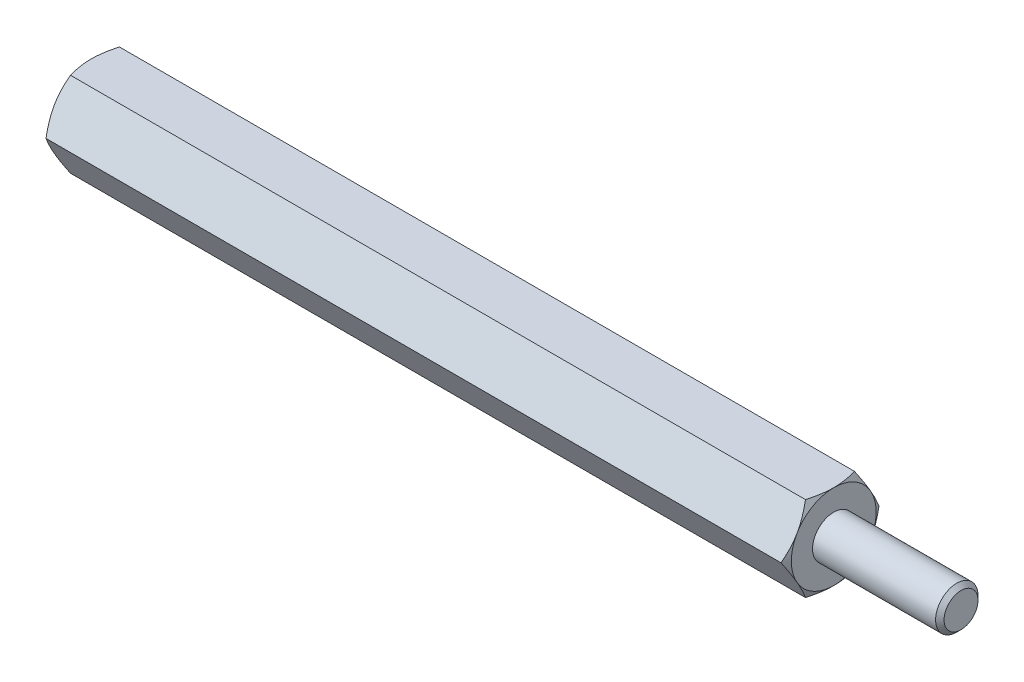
ISO-10303-21;
HEADER;
FILE_DESCRIPTION(('STEP AP214'),'2;1');
FILE_NAME('part.step','',(''),(''),'','','');
FILE_SCHEMA(('AUTOMOTIVE_DESIGN { 1 0 10303 214 1 1 1 1 }'));
ENDSEC;
DATA;
#1=APPLICATION_CONTEXT('core data for automotive mechanical design processes');
#2=APPLICATION_PROTOCOL_DEFINITION('international standard','automotive_design',2000,#1);
#3=PRODUCT_CONTEXT('',#1,'mechanical');
#4=PRODUCT('Part','Part','',(#3));
#5=PRODUCT_RELATED_PRODUCT_CATEGORY('part','',(#4));
#6=PRODUCT_DEFINITION_FORMATION('','',#4);
#7=PRODUCT_DEFINITION_CONTEXT('part definition',#1,'design');
#8=PRODUCT_DEFINITION('design','',#6,#7);
#9=PRODUCT_DEFINITION_SHAPE('','',#8);
#10=(LENGTH_UNIT() NAMED_UNIT(*) SI_UNIT(.MILLI.,.METRE.));
#11=(NAMED_UNIT(*) PLANE_ANGLE_UNIT() SI_UNIT($,.RADIAN.));
#12=(NAMED_UNIT(*) SI_UNIT($,.STERADIAN.) SOLID_ANGLE_UNIT());
#13=UNCERTAINTY_MEASURE_WITH_UNIT(LENGTH_MEASURE(1.E-05),#10,'distance_accuracy_value','');
#14=(GEOMETRIC_REPRESENTATION_CONTEXT(3) GLOBAL_UNCERTAINTY_ASSIGNED_CONTEXT((#13)) GLOBAL_UNIT_ASSIGNED_CONTEXT((#10,
#11,#12)) REPRESENTATION_CONTEXT('',''));
#15=CARTESIAN_POINT('',(0.,0.,0.));
#16=DIRECTION('',(0.,0.,1.));
#17=DIRECTION('',(1.,0.,0.));
#18=AXIS2_PLACEMENT_3D('',#15,#16,#17);
#19=CARTESIAN_POINT('',(17.5,2.,-1.15470053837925));
#20=DIRECTION('',(1.,0.,0.));
#21=DIRECTION('',(0.,0.,-1.));
#22=AXIS2_PLACEMENT_3D('',#19,#20,#21);
#23=PLANE('',#22);
#24=CARTESIAN_POINT('',(17.5,0.,0.));
#25=DIRECTION('',(1.,0.,0.));
#26=DIRECTION('',(0.,0.,-1.));
#27=AXIS2_PLACEMENT_3D('',#24,#25,#26);
#28=CIRCLE('',#27,2.);
#29=CARTESIAN_POINT('',(17.5,-1.,-1.73205080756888));
#30=VERTEX_POINT('',#29);
#31=CARTESIAN_POINT('',(17.5,0.999999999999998,-1.73205080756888));
#32=VERTEX_POINT('',#31);
#33=EDGE_CURVE('E288',#30,#32,#28,.T.);
#34=ORIENTED_EDGE('',*,*,#33,.T.);
#35=CARTESIAN_POINT('',(17.5,2.,0.));
#36=VERTEX_POINT('',#35);
#37=EDGE_CURVE('E53',#32,#36,#28,.T.);
#38=ORIENTED_EDGE('',*,*,#37,.T.);
#39=CARTESIAN_POINT('',(17.5,0.999999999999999,1.73205080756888));
#40=VERTEX_POINT('',#39);
#41=EDGE_CURVE('E297',#36,#40,#28,.T.);
#42=ORIENTED_EDGE('',*,*,#41,.T.);
#43=CARTESIAN_POINT('',(17.5,-1.00000000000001,1.73205080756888));
#44=VERTEX_POINT('',#43);
#45=EDGE_CURVE('E303',#40,#44,#28,.T.);
#46=ORIENTED_EDGE('',*,*,#45,.T.);
#47=CARTESIAN_POINT('',(17.5,0.,0.));
#48=DIRECTION('',(-1.,0.,0.));
#49=DIRECTION('',(0.,-1.,0.));
#50=AXIS2_PLACEMENT_3D('',#47,#48,#49);
#51=CIRCLE('',#50,2.);
#52=CARTESIAN_POINT('',(17.5,-2.00000000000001,0.));
#53=VERTEX_POINT('',#52);
#54=EDGE_CURVE('E193',#53,#44,#51,.T.);
#55=ORIENTED_EDGE('',*,*,#54,.F.);
#56=EDGE_CURVE('E61',#53,#30,#28,.T.);
#57=ORIENTED_EDGE('',*,*,#56,.T.);
#58=EDGE_LOOP('',(#34,#38,#42,#46,#55,#57));
#59=FACE_BOUND('',#58,.T.);
#60=CARTESIAN_POINT('',(17.5,0.,0.));
#61=DIRECTION('',(1.,0.,0.));
#62=DIRECTION('',(0.,0.,-1.));
#63=AXIS2_PLACEMENT_3D('',#60,#61,#62);
#64=CIRCLE('',#63,1.);
#65=CARTESIAN_POINT('',(17.5,0.,-1.));
#66=VERTEX_POINT('',#65);
#67=EDGE_CURVE('E606',#66,#66,#64,.T.);
#68=ORIENTED_EDGE('',*,*,#67,.F.);
#69=EDGE_LOOP('',(#68));
#70=FACE_BOUND('',#69,.T.);
#71=ADVANCED_FACE('F37',(#59,#70),#23,.T.);
#72=CARTESIAN_POINT('',(17.5,0.,-2.3094010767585));
#73=DIRECTION('',(0.,-0.5,0.866025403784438));
#74=DIRECTION('',(0.,-0.866025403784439,-0.5));
#75=AXIS2_PLACEMENT_3D('',#72,#73,#74);
#76=PLANE('',#75);
#77=CARTESIAN_POINT('',(17.3213005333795,-0.000200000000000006,-2.30951654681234));
#78=CARTESIAN_POINT('',(17.3506104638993,0.0876912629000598,-2.25877250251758));
#79=CARTESIAN_POINT('',(17.3772671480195,0.176341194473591,-2.20759044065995));
#80=CARTESIAN_POINT('',(17.4237975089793,0.355176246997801,-2.10433997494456));
#81=CARTESIAN_POINT('',(17.4436547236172,0.445364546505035,-2.05226973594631));
#82=CARTESIAN_POINT('',(17.4745665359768,0.624623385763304,-1.94877459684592));
#83=CARTESIAN_POINT('',(17.4858268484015,0.713666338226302,-1.89736562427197));
#84=CARTESIAN_POINT('',(17.4992713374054,0.892171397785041,-1.79430568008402));
#85=CARTESIAN_POINT('',(17.5014666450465,0.981632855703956,-1.74265508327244));
#86=CARTESIAN_POINT('',(17.4969090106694,1.1488083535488,-1.64613626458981));
#87=CARTESIAN_POINT('',(17.491275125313,1.22654737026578,-1.60125362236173));
#88=CARTESIAN_POINT('',(17.4734161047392,1.38151891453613,-1.51178075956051));
#89=CARTESIAN_POINT('',(17.4611848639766,1.4587509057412,-1.46719084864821));
#90=CARTESIAN_POINT('',(17.4306065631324,1.6140421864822,-1.37753338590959));
#91=CARTESIAN_POINT('',(17.4121298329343,1.69208181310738,-1.33247718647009));
#92=CARTESIAN_POINT('',(17.3701944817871,1.84699686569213,-1.24303693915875));
#93=CARTESIAN_POINT('',(17.3467457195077,1.92387427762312,-1.1986517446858));
#94=CARTESIAN_POINT('',(17.3213005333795,2.0002,-1.15458506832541));
#95=B_SPLINE_CURVE_WITH_KNOTS('',3,(#77,#78,#79,#80,#81,#82,#83,#84,#85,#86,#87,#88,#89,#90,#91,
#92,#93,#94),.UNSPECIFIED.,.F.,.F.,(4,2,2,2,2,2,2,2,4),(0.,0.317031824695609,0.634825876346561,
0.944753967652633,1.25430138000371,1.52387047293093,1.79368946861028,2.06949491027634,
2.34475850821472),.UNSPECIFIED.);
#96=CARTESIAN_POINT('',(17.3213672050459,0.,-2.3094010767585));
#97=VERTEX_POINT('',#96);
#98=EDGE_CURVE('E350',#97,#32,#95,.T.);
#99=ORIENTED_EDGE('',*,*,#98,.F.);
#100=DIRECTION('',(-1.,0.,0.));
#101=VECTOR('',#100,1.);
#102=CARTESIAN_POINT('',(17.5,0.,-2.3094010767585));
#103=LINE('',#102,#101);
#104=CARTESIAN_POINT('',(-17.3213672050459,0.,-2.3094010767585));
#105=VERTEX_POINT('',#104);
#106=EDGE_CURVE('E264',#97,#105,#103,.T.);
#107=ORIENTED_EDGE('',*,*,#106,.T.);
#108=CARTESIAN_POINT('',(-17.3213005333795,2.0002,-1.15458506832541));
#109=CARTESIAN_POINT('',(-17.3506104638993,1.91230873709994,-1.20532911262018));
#110=CARTESIAN_POINT('',(-17.3772671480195,1.82365880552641,-1.2565111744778));
#111=CARTESIAN_POINT('',(-17.4237975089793,1.6448237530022,-1.35976164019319));
#112=CARTESIAN_POINT('',(-17.4436547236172,1.55463545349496,-1.41183187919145));
#113=CARTESIAN_POINT('',(-17.4745665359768,1.37537661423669,-1.51532701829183));
#114=CARTESIAN_POINT('',(-17.4858268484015,1.2863336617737,-1.56673599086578));
#115=CARTESIAN_POINT('',(-17.4992713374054,1.10782860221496,-1.66979593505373));
#116=CARTESIAN_POINT('',(-17.5014666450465,1.01836714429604,-1.72144653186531));
#117=CARTESIAN_POINT('',(-17.4969090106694,0.851191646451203,-1.81796535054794));
#118=CARTESIAN_POINT('',(-17.491275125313,0.773452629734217,-1.86284799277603));
#119=CARTESIAN_POINT('',(-17.4734161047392,0.618481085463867,-1.95232085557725));
#120=CARTESIAN_POINT('',(-17.4611848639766,0.541249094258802,-1.99691076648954));
#121=CARTESIAN_POINT('',(-17.4306065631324,0.3859578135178,-2.08656822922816));
#122=CARTESIAN_POINT('',(-17.4121298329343,0.307918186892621,-2.13162442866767));
#123=CARTESIAN_POINT('',(-17.3701944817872,0.153003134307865,-2.221064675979));
#124=CARTESIAN_POINT('',(-17.3467457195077,0.0761257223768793,-2.26544987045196));
#125=CARTESIAN_POINT('',(-17.3213005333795,-0.000200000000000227,-2.30951654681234));
#126=B_SPLINE_CURVE_WITH_KNOTS('',3,(#108,#109,#110,#111,#112,#113,#114,#115,#116,#117,#118,
#119,#120,#121,#122,#123,#124,#125),.UNSPECIFIED.,.F.,.F.,(4,2,2,2,2,2,2,2,4),(0.,
0.317031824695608,0.634825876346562,0.944753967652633,1.25430138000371,1.52387047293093,
1.79368946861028,2.06949491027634,2.34475850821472),.UNSPECIFIED.);
#127=CARTESIAN_POINT('',(-17.5,0.999999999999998,-1.73205080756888));
#128=VERTEX_POINT('',#127);
#129=EDGE_CURVE('E324',#128,#105,#126,.T.);
#130=ORIENTED_EDGE('',*,*,#129,.F.);
#131=CARTESIAN_POINT('',(-17.3213672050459,2.,-1.15470053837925));
#132=VERTEX_POINT('',#131);
#133=EDGE_CURVE('E322',#132,#128,#126,.T.);
#134=ORIENTED_EDGE('',*,*,#133,.F.);
#135=DIRECTION('',(-1.,0.,0.));
#136=VECTOR('',#135,1.);
#137=CARTESIAN_POINT('',(17.5,2.,-1.15470053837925));
#138=LINE('',#137,#136);
#139=CARTESIAN_POINT('',(17.321367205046,2.,-1.15470053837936));
#140=VERTEX_POINT('',#139);
#141=EDGE_CURVE('E279',#140,#132,#138,.T.);
#142=ORIENTED_EDGE('',*,*,#141,.F.);
#143=EDGE_CURVE('E229',#32,#140,#95,.T.);
#144=ORIENTED_EDGE('',*,*,#143,.F.);
#145=EDGE_LOOP('',(#99,#107,#130,#134,#142,#144));
#146=FACE_BOUND('',#145,.T.);
#147=ADVANCED_FACE('F148',(#146),#76,.F.);
#148=CARTESIAN_POINT('',(17.5,2.,-1.15470053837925));
#149=DIRECTION('',(0.,-1.,0.));
#150=DIRECTION('',(0.,0.,-1.));
#151=AXIS2_PLACEMENT_3D('',#148,#149,#150);
#152=PLANE('',#151);
#153=CARTESIAN_POINT('',(16.5041453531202,2.,-3.14239762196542));
#154=CARTESIAN_POINT('',(16.5468568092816,2.,-3.05468337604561));
#155=CARTESIAN_POINT('',(16.5891703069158,2.,-2.96677207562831));
#156=CARTESIAN_POINT('',(16.6727783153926,2.,-2.79045070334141));
#157=CARTESIAN_POINT('',(16.7140726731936,2.,-2.70204055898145));
#158=CARTESIAN_POINT('',(16.7956183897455,2.,-2.52418069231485));
#159=CARTESIAN_POINT('',(16.8358631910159,2.,-2.43472795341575));
#160=CARTESIAN_POINT('',(16.9147590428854,2.,-2.25512498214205));
#161=CARTESIAN_POINT('',(16.9534101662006,2.,-2.16497478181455));
#162=CARTESIAN_POINT('',(17.0299661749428,2.,-1.98078525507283));
#163=CARTESIAN_POINT('',(17.0678021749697,2.,-1.88671714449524));
#164=CARTESIAN_POINT('',(17.1407004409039,2.,-1.69751412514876));
#165=CARTESIAN_POINT('',(17.1757629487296,2.,-1.60237931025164));
#166=CARTESIAN_POINT('',(17.2422353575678,2.,-1.41102905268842));
#167=CARTESIAN_POINT('',(17.2736519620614,2.,-1.31481596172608));
#168=CARTESIAN_POINT('',(17.3318476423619,2.,-1.12101028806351));
#169=CARTESIAN_POINT('',(17.3586281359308,2.,-1.02341813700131));
#170=CARTESIAN_POINT('',(17.4061516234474,2.,-0.827336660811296));
#171=CARTESIAN_POINT('',(17.4269281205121,2.,-0.728855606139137));
#172=CARTESIAN_POINT('',(17.4612955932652,2.,-0.530628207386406));
#173=CARTESIAN_POINT('',(17.4748873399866,2.,-0.430882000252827));
#174=CARTESIAN_POINT('',(17.4936215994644,2.,-0.231937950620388));
#175=CARTESIAN_POINT('',(17.498875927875,2.,-0.132750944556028));
#176=CARTESIAN_POINT('',(17.5007996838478,2.,0.0657049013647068));
#177=CARTESIAN_POINT('',(17.4974689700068,2.,0.164973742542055));
#178=CARTESIAN_POINT('',(17.4796512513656,2.,0.400692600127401));
#179=CARTESIAN_POINT('',(17.4613884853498,2.,0.53685971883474));
#180=CARTESIAN_POINT('',(17.4117995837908,2.,0.806792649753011));
#181=CARTESIAN_POINT('',(17.3804615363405,2.,0.940556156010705));
#182=CARTESIAN_POINT('',(17.3073369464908,2.,1.20849227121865));
#183=CARTESIAN_POINT('',(17.2653231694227,2.,1.34260127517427));
#184=CARTESIAN_POINT('',(17.1970115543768,2.,1.54188460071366));
#185=CARTESIAN_POINT('',(17.1733612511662,2.,1.6079939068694));
#186=CARTESIAN_POINT('',(17.1245731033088,2.,1.73966131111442));
#187=CARTESIAN_POINT('',(17.0994352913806,2.,1.8052194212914));
#188=CARTESIAN_POINT('',(17.030452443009,2.,1.98014362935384));
#189=CARTESIAN_POINT('',(16.9854828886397,2.,2.08906517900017));
#190=CARTESIAN_POINT('',(16.8929395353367,2.,2.30580041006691));
#191=CARTESIAN_POINT('',(16.845365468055,2.,2.41361397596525));
#192=CARTESIAN_POINT('',(16.7482262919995,2.,2.62838132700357));
#193=CARTESIAN_POINT('',(16.6986605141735,2.,2.73533480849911));
#194=CARTESIAN_POINT('',(16.5980014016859,2.,2.94852186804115));
#195=CARTESIAN_POINT('',(16.546908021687,2.,3.05475542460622));
#196=CARTESIAN_POINT('',(16.3916961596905,2.,3.37291303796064));
#197=CARTESIAN_POINT('',(16.2857965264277,2.,3.58396705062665));
#198=CARTESIAN_POINT('',(16.0710098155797,2.,4.00448363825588));
#199=CARTESIAN_POINT('',(15.9621233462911,2.,4.21394652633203));
#200=CARTESIAN_POINT('',(15.7537677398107,2.,4.61000648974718));
#201=CARTESIAN_POINT('',(15.6545007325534,2.,4.79671008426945));
#202=CARTESIAN_POINT('',(15.4547641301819,2.,5.16948614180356));
#203=CARTESIAN_POINT('',(15.3542944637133,2.,5.35555856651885));
#204=CARTESIAN_POINT('',(15.1527937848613,2.,5.72660635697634));
#205=CARTESIAN_POINT('',(15.0517657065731,2.,5.91158331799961));
#206=CARTESIAN_POINT('',(14.8490239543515,2.,6.28114276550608));
#207=CARTESIAN_POINT('',(14.7473103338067,2.,6.46572528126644));
#208=CARTESIAN_POINT('',(14.6453470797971,2.,6.65016883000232));
#209=B_SPLINE_CURVE_WITH_KNOTS('',3,(#153,#154,#155,#156,#157,#158,#159,#160,#161,#162,#163,
#164,#165,#166,#167,#168,#169,#170,#171,#172,#173,#174,#175,#176,#177,#178,#179,#180,#181,#182,
#183,#184,#185,#186,#187,#188,#189,#190,#191,#192,#193,#194,#195,#196,#197,#198,#199,#200,#201,
#202,#203,#204,#205,#206,#207,#208),.UNSPECIFIED.,.F.,.F.,(4,2,2,2,2,2,2,2,2,2,2,2,2,2,2,2,2,2,
2,2,2,2,2,2,2,2,2,4),(0.,0.292684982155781,0.585413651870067,0.879667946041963,1.17390879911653,
1.47805164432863,1.78216793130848,2.08571589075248,2.38917085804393,2.690898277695,
2.99259331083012,3.29020694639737,3.58782548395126,3.99913738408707,4.41082482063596,
4.8321411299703,5.04276628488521,5.25338680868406,5.6068563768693,5.96036243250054,
6.31398824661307,6.66762456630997,7.37597688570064,8.08418599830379,8.71853756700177,
9.3529269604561,9.98522933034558,10.6174830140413),.UNSPECIFIED.);
#210=EDGE_CURVE('E227',#140,#36,#209,.T.);
#211=ORIENTED_EDGE('',*,*,#210,.F.);
#212=ORIENTED_EDGE('',*,*,#141,.T.);
#213=CARTESIAN_POINT('',(-16.5041453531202,2.,-3.14239762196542));
#214=CARTESIAN_POINT('',(-16.5468568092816,2.,-3.05468337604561));
#215=CARTESIAN_POINT('',(-16.5891703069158,2.,-2.96677207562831));
#216=CARTESIAN_POINT('',(-16.6727783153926,2.,-2.79045070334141));
#217=CARTESIAN_POINT('',(-16.7140726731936,2.,-2.70204055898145));
#218=CARTESIAN_POINT('',(-16.7956183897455,2.,-2.52418069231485));
#219=CARTESIAN_POINT('',(-16.8358631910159,2.,-2.43472795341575));
#220=CARTESIAN_POINT('',(-16.9147590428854,2.,-2.25512498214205));
#221=CARTESIAN_POINT('',(-16.9534101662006,2.,-2.16497478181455));
#222=CARTESIAN_POINT('',(-17.0299661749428,2.,-1.98078525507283));
#223=CARTESIAN_POINT('',(-17.0678021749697,2.,-1.88671714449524));
#224=CARTESIAN_POINT('',(-17.1407004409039,2.,-1.69751412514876));
#225=CARTESIAN_POINT('',(-17.1757629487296,2.,-1.60237931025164));
#226=CARTESIAN_POINT('',(-17.2422353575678,2.,-1.41102905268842));
#227=CARTESIAN_POINT('',(-17.2736519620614,2.,-1.31481596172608));
#228=CARTESIAN_POINT('',(-17.3318476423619,2.,-1.12101028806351));
#229=CARTESIAN_POINT('',(-17.3586281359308,2.,-1.02341813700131));
#230=CARTESIAN_POINT('',(-17.4061516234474,2.,-0.827336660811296));
#231=CARTESIAN_POINT('',(-17.4269281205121,2.,-0.728855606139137));
#232=CARTESIAN_POINT('',(-17.4612955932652,2.,-0.530628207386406));
#233=CARTESIAN_POINT('',(-17.4748873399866,2.,-0.430882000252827));
#234=CARTESIAN_POINT('',(-17.4936215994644,2.,-0.231937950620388));
#235=CARTESIAN_POINT('',(-17.498875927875,2.,-0.132750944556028));
#236=CARTESIAN_POINT('',(-17.5007996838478,2.,0.0657049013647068));
#237=CARTESIAN_POINT('',(-17.4974689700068,2.,0.164973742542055));
#238=CARTESIAN_POINT('',(-17.4796512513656,2.,0.400692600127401));
#239=CARTESIAN_POINT('',(-17.4613884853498,2.,0.53685971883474));
#240=CARTESIAN_POINT('',(-17.4117995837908,2.,0.806792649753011));
#241=CARTESIAN_POINT('',(-17.3804615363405,2.,0.940556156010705));
#242=CARTESIAN_POINT('',(-17.3073369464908,2.,1.20849227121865));
#243=CARTESIAN_POINT('',(-17.2653231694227,2.,1.34260127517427));
#244=CARTESIAN_POINT('',(-17.1970115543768,2.,1.54188460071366));
#245=CARTESIAN_POINT('',(-17.1733612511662,2.,1.6079939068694));
#246=CARTESIAN_POINT('',(-17.1245731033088,2.,1.73966131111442));
#247=CARTESIAN_POINT('',(-17.0994352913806,2.,1.8052194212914));
#248=CARTESIAN_POINT('',(-17.030452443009,2.,1.98014362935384));
#249=CARTESIAN_POINT('',(-16.9854828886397,2.,2.08906517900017));
#250=CARTESIAN_POINT('',(-16.8929395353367,2.,2.30580041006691));
#251=CARTESIAN_POINT('',(-16.845365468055,2.,2.41361397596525));
#252=CARTESIAN_POINT('',(-16.7482262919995,2.,2.62838132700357));
#253=CARTESIAN_POINT('',(-16.6986605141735,2.,2.73533480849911));
#254=CARTESIAN_POINT('',(-16.5980014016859,2.,2.94852186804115));
#255=CARTESIAN_POINT('',(-16.546908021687,2.,3.05475542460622));
#256=CARTESIAN_POINT('',(-16.3916961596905,2.,3.37291303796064));
#257=CARTESIAN_POINT('',(-16.2857965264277,2.,3.58396705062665));
#258=CARTESIAN_POINT('',(-16.0710098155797,2.,4.00448363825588));
#259=CARTESIAN_POINT('',(-15.9621233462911,2.,4.21394652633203));
#260=CARTESIAN_POINT('',(-15.7537677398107,2.,4.61000648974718));
#261=CARTESIAN_POINT('',(-15.6545007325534,2.,4.79671008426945));
#262=CARTESIAN_POINT('',(-15.4547641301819,2.,5.16948614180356));
#263=CARTESIAN_POINT('',(-15.3542944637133,2.,5.35555856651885));
#264=CARTESIAN_POINT('',(-15.1527937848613,2.,5.72660635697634));
#265=CARTESIAN_POINT('',(-15.0517657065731,2.,5.91158331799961));
#266=CARTESIAN_POINT('',(-14.8490239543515,2.,6.28114276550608));
#267=CARTESIAN_POINT('',(-14.7473103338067,2.,6.46572528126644));
#268=CARTESIAN_POINT('',(-14.6453470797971,2.,6.65016883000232));
#269=B_SPLINE_CURVE_WITH_KNOTS('',3,(#213,#214,#215,#216,#217,#218,#219,#220,#221,#222,#223,
#224,#225,#226,#227,#228,#229,#230,#231,#232,#233,#234,#235,#236,#237,#238,#239,#240,#241,#242,
#243,#244,#245,#246,#247,#248,#249,#250,#251,#252,#253,#254,#255,#256,#257,#258,#259,#260,#261,
#262,#263,#264,#265,#266,#267,#268),.UNSPECIFIED.,.F.,.F.,(4,2,2,2,2,2,2,2,2,2,2,2,2,2,2,2,2,2,
2,2,2,2,2,2,2,2,2,4),(0.,0.292684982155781,0.585413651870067,0.879667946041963,1.17390879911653,
1.47805164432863,1.78216793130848,2.08571589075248,2.38917085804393,2.690898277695,
2.99259331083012,3.29020694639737,3.58782548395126,3.99913738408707,4.41082482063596,
4.8321411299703,5.04276628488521,5.25338680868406,5.6068563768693,5.96036243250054,
6.31398824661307,6.66762456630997,7.37597688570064,8.08418599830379,8.71853756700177,
9.3529269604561,9.98522933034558,10.6174830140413),.UNSPECIFIED.);
#270=CARTESIAN_POINT('',(-17.5,2.,0.));
#271=VERTEX_POINT('',#270);
#272=EDGE_CURVE('E241',#271,#132,#269,.F.);
#273=ORIENTED_EDGE('',*,*,#272,.F.);
#274=CARTESIAN_POINT('',(-17.3213672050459,2.,1.15470053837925));
#275=VERTEX_POINT('',#274);
#276=EDGE_CURVE('E249',#275,#271,#269,.F.);
#277=ORIENTED_EDGE('',*,*,#276,.F.);
#278=DIRECTION('',(-1.,0.,0.));
#279=VECTOR('',#278,1.);
#280=CARTESIAN_POINT('',(17.5,2.,1.15470053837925));
#281=LINE('',#280,#279);
#282=CARTESIAN_POINT('',(17.3213672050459,2.,1.15470053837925));
#283=VERTEX_POINT('',#282);
#284=EDGE_CURVE('E276',#283,#275,#281,.T.);
#285=ORIENTED_EDGE('',*,*,#284,.F.);
#286=EDGE_CURVE('E221',#36,#283,#209,.T.);
#287=ORIENTED_EDGE('',*,*,#286,.F.);
#288=EDGE_LOOP('',(#211,#212,#273,#277,#285,#287));
#289=FACE_BOUND('',#288,.T.);
#290=ADVANCED_FACE('F153',(#289),#152,.F.);
#291=CARTESIAN_POINT('',(17.5,2.,1.15470053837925));
#292=DIRECTION('',(0.,-0.5,-0.866025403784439));
#293=DIRECTION('',(0.,0.866025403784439,-0.5));
#294=AXIS2_PLACEMENT_3D('',#291,#292,#293);
#295=PLANE('',#294);
#296=CARTESIAN_POINT('',(17.3213005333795,2.0002,1.15458506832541));
#297=CARTESIAN_POINT('',(17.3506104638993,1.91230873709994,1.20532911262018));
#298=CARTESIAN_POINT('',(17.3772671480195,1.82365880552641,1.2565111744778));
#299=CARTESIAN_POINT('',(17.4237975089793,1.6448237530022,1.35976164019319));
#300=CARTESIAN_POINT('',(17.4436547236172,1.55463545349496,1.41183187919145));
#301=CARTESIAN_POINT('',(17.4745665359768,1.37537661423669,1.51532701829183));
#302=CARTESIAN_POINT('',(17.4858268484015,1.2863336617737,1.56673599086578));
#303=CARTESIAN_POINT('',(17.4992713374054,1.10782860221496,1.66979593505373));
#304=CARTESIAN_POINT('',(17.5014666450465,1.01836714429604,1.72144653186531));
#305=CARTESIAN_POINT('',(17.4969090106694,0.851191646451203,1.81796535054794));
#306=CARTESIAN_POINT('',(17.491275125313,0.773452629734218,1.86284799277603));
#307=CARTESIAN_POINT('',(17.4734161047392,0.618481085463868,1.95232085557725));
#308=CARTESIAN_POINT('',(17.4611848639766,0.541249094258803,1.99691076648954));
#309=CARTESIAN_POINT('',(17.4306065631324,0.3859578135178,2.08656822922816));
#310=CARTESIAN_POINT('',(17.4121298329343,0.307918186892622,2.13162442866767));
#311=CARTESIAN_POINT('',(17.3701944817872,0.153003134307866,2.221064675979));
#312=CARTESIAN_POINT('',(17.3467457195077,0.076125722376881,2.26544987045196));
#313=CARTESIAN_POINT('',(17.3213005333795,-0.000199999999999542,2.30951654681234));
#314=B_SPLINE_CURVE_WITH_KNOTS('',3,(#296,#297,#298,#299,#300,#301,#302,#303,#304,#305,#306,
#307,#308,#309,#310,#311,#312,#313),.UNSPECIFIED.,.F.,.F.,(4,2,2,2,2,2,2,2,4),(0.,
0.317031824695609,0.634825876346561,0.944753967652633,1.25430138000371,1.52387047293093,
1.79368946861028,2.06949491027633,2.34475850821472),.UNSPECIFIED.);
#315=EDGE_CURVE('E228',#283,#40,#314,.T.);
#316=ORIENTED_EDGE('',*,*,#315,.F.);
#317=ORIENTED_EDGE('',*,*,#284,.T.);
#318=CARTESIAN_POINT('',(-17.3213005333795,-0.000199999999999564,2.30951654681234));
#319=CARTESIAN_POINT('',(-17.3506104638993,0.0876912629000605,2.25877250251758));
#320=CARTESIAN_POINT('',(-17.3772671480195,0.176341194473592,2.20759044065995));
#321=CARTESIAN_POINT('',(-17.4237975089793,0.355176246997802,2.10433997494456));
#322=CARTESIAN_POINT('',(-17.4436547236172,0.445364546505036,2.0522697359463));
#323=CARTESIAN_POINT('',(-17.4745665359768,0.624623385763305,1.94877459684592));
#324=CARTESIAN_POINT('',(-17.4858268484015,0.713666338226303,1.89736562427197));
#325=CARTESIAN_POINT('',(-17.4992713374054,0.892171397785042,1.79430568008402));
#326=CARTESIAN_POINT('',(-17.5014666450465,0.981632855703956,1.74265508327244));
#327=CARTESIAN_POINT('',(-17.4969090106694,1.1488083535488,1.64613626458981));
#328=CARTESIAN_POINT('',(-17.491275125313,1.22654737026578,1.60125362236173));
#329=CARTESIAN_POINT('',(-17.4734161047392,1.38151891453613,1.51178075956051));
#330=CARTESIAN_POINT('',(-17.4611848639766,1.4587509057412,1.46719084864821));
#331=CARTESIAN_POINT('',(-17.4306065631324,1.6140421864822,1.37753338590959));
#332=CARTESIAN_POINT('',(-17.4121298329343,1.69208181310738,1.33247718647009));
#333=CARTESIAN_POINT('',(-17.3701944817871,1.84699686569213,1.24303693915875));
#334=CARTESIAN_POINT('',(-17.3467457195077,1.92387427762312,1.1986517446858));
#335=CARTESIAN_POINT('',(-17.3213005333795,2.0002,1.15458506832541));
#336=B_SPLINE_CURVE_WITH_KNOTS('',3,(#318,#319,#320,#321,#322,#323,#324,#325,#326,#327,#328,
#329,#330,#331,#332,#333,#334,#335),.UNSPECIFIED.,.F.,.F.,(4,2,2,2,2,2,2,2,4),(0.,
0.317031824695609,0.634825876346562,0.944753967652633,1.25430138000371,1.52387047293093,
1.79368946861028,2.06949491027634,2.34475850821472),.UNSPECIFIED.);
#337=CARTESIAN_POINT('',(-17.5,0.999999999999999,1.73205080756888));
#338=VERTEX_POINT('',#337);
#339=EDGE_CURVE('E255',#338,#275,#336,.T.);
#340=ORIENTED_EDGE('',*,*,#339,.F.);
#341=CARTESIAN_POINT('',(-17.3213672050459,0.,2.3094010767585));
#342=VERTEX_POINT('',#341);
#343=EDGE_CURVE('E262',#342,#338,#336,.T.);
#344=ORIENTED_EDGE('',*,*,#343,.F.);
#345=DIRECTION('',(-1.,0.,0.));
#346=VECTOR('',#345,1.);
#347=CARTESIAN_POINT('',(17.5,0.,2.3094010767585));
#348=LINE('',#347,#346);
#349=CARTESIAN_POINT('',(17.3213672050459,0.,2.3094010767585));
#350=VERTEX_POINT('',#349);
#351=EDGE_CURVE('E273',#350,#342,#348,.T.);
#352=ORIENTED_EDGE('',*,*,#351,.F.);
#353=EDGE_CURVE('E215',#40,#350,#314,.T.);
#354=ORIENTED_EDGE('',*,*,#353,.F.);
#355=EDGE_LOOP('',(#316,#317,#340,#344,#352,#354));
#356=FACE_BOUND('',#355,.T.);
#357=ADVANCED_FACE('F235',(#356),#295,.F.);
#358=CARTESIAN_POINT('',(17.5,0.,2.3094010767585));
#359=DIRECTION('',(0.,0.5,-0.866025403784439));
#360=DIRECTION('',(0.,0.866025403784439,0.5));
#361=AXIS2_PLACEMENT_3D('',#358,#359,#360);
#362=PLANE('',#361);
#363=CARTESIAN_POINT('',(17.3213005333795,0.000200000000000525,2.30951654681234));
#364=CARTESIAN_POINT('',(17.3506104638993,-0.0876912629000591,2.25877250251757));
#365=CARTESIAN_POINT('',(17.3772671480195,-0.17634119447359,2.20759044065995));
#366=CARTESIAN_POINT('',(17.4237975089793,-0.355176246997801,2.10433997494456));
#367=CARTESIAN_POINT('',(17.4436547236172,-0.445364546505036,2.0522697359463));
#368=CARTESIAN_POINT('',(17.4745665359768,-0.624623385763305,1.94877459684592));
#369=CARTESIAN_POINT('',(17.4858268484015,-0.713666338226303,1.89736562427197));
#370=CARTESIAN_POINT('',(17.4992713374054,-0.892171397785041,1.79430568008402));
#371=CARTESIAN_POINT('',(17.5014666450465,-0.981632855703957,1.74265508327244));
#372=CARTESIAN_POINT('',(17.4969090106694,-1.1488083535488,1.64613626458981));
#373=CARTESIAN_POINT('',(17.491275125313,-1.22654737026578,1.60125362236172));
#374=CARTESIAN_POINT('',(17.4734161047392,-1.38151891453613,1.51178075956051));
#375=CARTESIAN_POINT('',(17.4611848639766,-1.4587509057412,1.46719084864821));
#376=CARTESIAN_POINT('',(17.4306065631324,-1.6140421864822,1.37753338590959));
#377=CARTESIAN_POINT('',(17.4121298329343,-1.69208181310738,1.33247718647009));
#378=CARTESIAN_POINT('',(17.3701944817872,-1.84699686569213,1.24303693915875));
#379=CARTESIAN_POINT('',(17.3467457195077,-1.92387427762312,1.1986517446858));
#380=CARTESIAN_POINT('',(17.3213005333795,-2.0002,1.15458506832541));
#381=B_SPLINE_CURVE_WITH_KNOTS('',3,(#363,#364,#365,#366,#367,#368,#369,#370,#371,#372,#373,
#374,#375,#376,#377,#378,#379,#380),.UNSPECIFIED.,.F.,.F.,(4,2,2,2,2,2,2,2,4),(0.,
0.31703182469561,0.634825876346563,0.944753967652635,1.25430138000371,1.52387047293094,
1.79368946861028,2.06949491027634,2.34475850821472),.UNSPECIFIED.);
#382=EDGE_CURVE('E315',#350,#44,#381,.T.);
#383=ORIENTED_EDGE('',*,*,#382,.F.);
#384=ORIENTED_EDGE('',*,*,#351,.T.);
#385=CARTESIAN_POINT('',(-17.3213005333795,-2.0002,1.15458506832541));
#386=CARTESIAN_POINT('',(-17.3506104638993,-1.91230873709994,1.20532911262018));
#387=CARTESIAN_POINT('',(-17.3772671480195,-1.82365880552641,1.2565111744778));
#388=CARTESIAN_POINT('',(-17.4237975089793,-1.6448237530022,1.35976164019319));
#389=CARTESIAN_POINT('',(-17.4436547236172,-1.55463545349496,1.41183187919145));
#390=CARTESIAN_POINT('',(-17.4745665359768,-1.3753766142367,1.51532701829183));
#391=CARTESIAN_POINT('',(-17.4858268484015,-1.2863336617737,1.56673599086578));
#392=CARTESIAN_POINT('',(-17.4992713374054,-1.10782860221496,1.66979593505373));
#393=CARTESIAN_POINT('',(-17.5014666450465,-1.01836714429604,1.72144653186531));
#394=CARTESIAN_POINT('',(-17.4969090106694,-0.851191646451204,1.81796535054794));
#395=CARTESIAN_POINT('',(-17.491275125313,-0.773452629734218,1.86284799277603));
#396=CARTESIAN_POINT('',(-17.4734161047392,-0.618481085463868,1.95232085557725));
#397=CARTESIAN_POINT('',(-17.4611848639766,-0.541249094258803,1.99691076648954));
#398=CARTESIAN_POINT('',(-17.4306065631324,-0.3859578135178,2.08656822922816));
#399=CARTESIAN_POINT('',(-17.4121298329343,-0.307918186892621,2.13162442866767));
#400=CARTESIAN_POINT('',(-17.3701944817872,-0.153003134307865,2.221064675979));
#401=CARTESIAN_POINT('',(-17.3467457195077,-0.0761257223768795,2.26544987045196));
#402=CARTESIAN_POINT('',(-17.3213005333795,0.000200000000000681,2.30951654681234));
#403=B_SPLINE_CURVE_WITH_KNOTS('',3,(#385,#386,#387,#388,#389,#390,#391,#392,#393,#394,#395,
#396,#397,#398,#399,#400,#401,#402),.UNSPECIFIED.,.F.,.F.,(4,2,2,2,2,2,2,2,4),(0.,
0.317031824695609,0.634825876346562,0.944753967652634,1.25430138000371,1.52387047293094,
1.79368946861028,2.06949491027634,2.34475850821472),.UNSPECIFIED.);
#404=CARTESIAN_POINT('',(-17.5,-1.00000000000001,1.73205080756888));
#405=VERTEX_POINT('',#404);
#406=EDGE_CURVE('E263',#405,#342,#403,.T.);
#407=ORIENTED_EDGE('',*,*,#406,.F.);
#408=CARTESIAN_POINT('',(-17.3213672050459,-2.,1.15470053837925));
#409=VERTEX_POINT('',#408);
#410=EDGE_CURVE('E250',#409,#405,#403,.T.);
#411=ORIENTED_EDGE('',*,*,#410,.F.);
#412=DIRECTION('',(-1.,0.,0.));
#413=VECTOR('',#412,1.);
#414=CARTESIAN_POINT('',(17.5,-2.,1.15470053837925));
#415=LINE('',#414,#413);
#416=CARTESIAN_POINT('',(17.3213672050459,-2.,1.15470053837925));
#417=VERTEX_POINT('',#416);
#418=EDGE_CURVE('E270',#417,#409,#415,.T.);
#419=ORIENTED_EDGE('',*,*,#418,.F.);
#420=EDGE_CURVE('E210',#44,#417,#381,.T.);
#421=ORIENTED_EDGE('',*,*,#420,.F.);
#422=EDGE_LOOP('',(#383,#384,#407,#411,#419,#421));
#423=FACE_BOUND('',#422,.T.);
#424=ADVANCED_FACE('F424',(#423),#362,.F.);
#425=CARTESIAN_POINT('',(17.5,-2.,1.15470053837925));
#426=DIRECTION('',(0.,1.,0.));
#427=DIRECTION('',(0.,0.,1.));
#428=AXIS2_PLACEMENT_3D('',#425,#426,#427);
#429=PLANE('',#428);
#430=CARTESIAN_POINT('',(16.5041453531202,-2.,-3.14239762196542));
#431=CARTESIAN_POINT('',(16.5468568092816,-2.,-3.05468337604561));
#432=CARTESIAN_POINT('',(16.5891703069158,-2.,-2.96677207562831));
#433=CARTESIAN_POINT('',(16.6727783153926,-2.,-2.79045070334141));
#434=CARTESIAN_POINT('',(16.7140726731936,-2.,-2.70204055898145));
#435=CARTESIAN_POINT('',(16.7956183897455,-2.,-2.52418069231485));
#436=CARTESIAN_POINT('',(16.8358631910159,-2.,-2.43472795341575));
#437=CARTESIAN_POINT('',(16.9147590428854,-2.,-2.25512498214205));
#438=CARTESIAN_POINT('',(16.9534101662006,-2.,-2.16497478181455));
#439=CARTESIAN_POINT('',(17.0299661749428,-2.,-1.98078525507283));
#440=CARTESIAN_POINT('',(17.0678021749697,-2.,-1.88671714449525));
#441=CARTESIAN_POINT('',(17.1407004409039,-2.,-1.69751412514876));
#442=CARTESIAN_POINT('',(17.1757629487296,-2.,-1.60237931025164));
#443=CARTESIAN_POINT('',(17.2422353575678,-2.,-1.41102905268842));
#444=CARTESIAN_POINT('',(17.2736519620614,-2.,-1.31481596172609));
#445=CARTESIAN_POINT('',(17.3318476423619,-2.,-1.12101028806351));
#446=CARTESIAN_POINT('',(17.3586281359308,-2.,-1.02341813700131));
#447=CARTESIAN_POINT('',(17.4061516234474,-2.,-0.827336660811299));
#448=CARTESIAN_POINT('',(17.4269281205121,-2.,-0.728855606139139));
#449=CARTESIAN_POINT('',(17.4612955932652,-2.,-0.530628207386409));
#450=CARTESIAN_POINT('',(17.4748873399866,-2.,-0.430882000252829));
#451=CARTESIAN_POINT('',(17.4936215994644,-2.,-0.23193795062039));
#452=CARTESIAN_POINT('',(17.498875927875,-2.,-0.13275094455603));
#453=CARTESIAN_POINT('',(17.5007996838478,-2.,0.0657049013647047));
#454=CARTESIAN_POINT('',(17.4974689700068,-2.,0.164973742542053));
#455=CARTESIAN_POINT('',(17.4796512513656,-2.,0.400692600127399));
#456=CARTESIAN_POINT('',(17.4613884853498,-2.,0.536859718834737));
#457=CARTESIAN_POINT('',(17.4117995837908,-2.,0.806792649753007));
#458=CARTESIAN_POINT('',(17.3804615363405,-2.,0.940556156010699));
#459=CARTESIAN_POINT('',(17.3073369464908,-2.,1.20849227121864));
#460=CARTESIAN_POINT('',(17.2653231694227,-2.,1.34260127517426));
#461=CARTESIAN_POINT('',(17.1970115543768,-2.,1.54188460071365));
#462=CARTESIAN_POINT('',(17.1733612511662,-2.,1.6079939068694));
#463=CARTESIAN_POINT('',(17.1245731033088,-2.,1.73966131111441));
#464=CARTESIAN_POINT('',(17.0994352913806,-2.,1.80521942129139));
#465=CARTESIAN_POINT('',(17.030452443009,-2.,1.98014362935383));
#466=CARTESIAN_POINT('',(16.9854828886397,-2.,2.08906517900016));
#467=CARTESIAN_POINT('',(16.8929395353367,-2.,2.3058004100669));
#468=CARTESIAN_POINT('',(16.845365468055,-2.,2.41361397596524));
#469=CARTESIAN_POINT('',(16.7482262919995,-2.,2.62838132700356));
#470=CARTESIAN_POINT('',(16.6986605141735,-2.,2.7353348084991));
#471=CARTESIAN_POINT('',(16.5980014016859,-2.,2.94852186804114));
#472=CARTESIAN_POINT('',(16.546908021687,-2.,3.05475542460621));
#473=CARTESIAN_POINT('',(16.3916961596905,-2.,3.37291303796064));
#474=CARTESIAN_POINT('',(16.2857965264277,-2.,3.58396705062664));
#475=CARTESIAN_POINT('',(16.0710098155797,-2.,4.00448363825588));
#476=CARTESIAN_POINT('',(15.9621233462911,-2.,4.21394652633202));
#477=CARTESIAN_POINT('',(15.7537677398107,-2.,4.61000648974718));
#478=CARTESIAN_POINT('',(15.6545007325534,-2.,4.79671008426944));
#479=CARTESIAN_POINT('',(15.4547641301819,-2.,5.16948614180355));
#480=CARTESIAN_POINT('',(15.3542944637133,-2.,5.35555856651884));
#481=CARTESIAN_POINT('',(15.1527937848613,-2.,5.72660635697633));
#482=CARTESIAN_POINT('',(15.0517657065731,-2.,5.9115833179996));
#483=CARTESIAN_POINT('',(14.8490239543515,-2.,6.28114276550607));
#484=CARTESIAN_POINT('',(14.7473103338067,-2.,6.46572528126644));
#485=CARTESIAN_POINT('',(14.6453470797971,-2.,6.65016883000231));
#486=B_SPLINE_CURVE_WITH_KNOTS('',3,(#430,#431,#432,#433,#434,#435,#436,#437,#438,#439,#440,
#441,#442,#443,#444,#445,#446,#447,#448,#449,#450,#451,#452,#453,#454,#455,#456,#457,#458,#459,
#460,#461,#462,#463,#464,#465,#466,#467,#468,#469,#470,#471,#472,#473,#474,#475,#476,#477,#478,
#479,#480,#481,#482,#483,#484,#485),.UNSPECIFIED.,.F.,.F.,(4,2,2,2,2,2,2,2,2,2,2,2,2,2,2,2,2,2,
2,2,2,2,2,2,2,2,2,4),(0.,0.29268498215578,0.585413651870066,0.879667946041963,1.17390879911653,
1.47805164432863,1.78216793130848,2.08571589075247,2.38917085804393,2.69089827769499,
2.99259331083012,3.29020694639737,3.58782548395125,3.99913738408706,4.41082482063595,
4.83214112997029,5.0427662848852,5.25338680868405,5.60685637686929,5.96036243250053,
6.31398824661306,6.66762456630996,7.37597688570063,8.08418599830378,8.71853756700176,
9.35292696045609,9.98522933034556,10.6174830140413),.UNSPECIFIED.);
#487=EDGE_CURVE('E325',#417,#53,#486,.F.);
#488=ORIENTED_EDGE('',*,*,#487,.F.);
#489=ORIENTED_EDGE('',*,*,#418,.T.);
#490=CARTESIAN_POINT('',(-16.5041453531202,-2.,-3.14239762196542));
#491=CARTESIAN_POINT('',(-16.5468568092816,-2.,-3.05468337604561));
#492=CARTESIAN_POINT('',(-16.5891703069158,-2.,-2.96677207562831));
#493=CARTESIAN_POINT('',(-16.6727783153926,-2.,-2.79045070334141));
#494=CARTESIAN_POINT('',(-16.7140726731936,-2.,-2.70204055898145));
#495=CARTESIAN_POINT('',(-16.7956183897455,-2.,-2.52418069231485));
#496=CARTESIAN_POINT('',(-16.8358631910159,-2.,-2.43472795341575));
#497=CARTESIAN_POINT('',(-16.9147590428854,-2.,-2.25512498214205));
#498=CARTESIAN_POINT('',(-16.9534101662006,-2.,-2.16497478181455));
#499=CARTESIAN_POINT('',(-17.0299661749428,-2.,-1.98078525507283));
#500=CARTESIAN_POINT('',(-17.0678021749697,-2.,-1.88671714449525));
#501=CARTESIAN_POINT('',(-17.1407004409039,-2.,-1.69751412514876));
#502=CARTESIAN_POINT('',(-17.1757629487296,-2.,-1.60237931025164));
#503=CARTESIAN_POINT('',(-17.2422353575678,-2.,-1.41102905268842));
#504=CARTESIAN_POINT('',(-17.2736519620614,-2.,-1.31481596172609));
#505=CARTESIAN_POINT('',(-17.3318476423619,-2.,-1.12101028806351));
#506=CARTESIAN_POINT('',(-17.3586281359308,-2.,-1.02341813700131));
#507=CARTESIAN_POINT('',(-17.4061516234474,-2.,-0.827336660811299));
#508=CARTESIAN_POINT('',(-17.4269281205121,-2.,-0.728855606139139));
#509=CARTESIAN_POINT('',(-17.4612955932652,-2.,-0.530628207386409));
#510=CARTESIAN_POINT('',(-17.4748873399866,-2.,-0.430882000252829));
#511=CARTESIAN_POINT('',(-17.4936215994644,-2.,-0.23193795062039));
#512=CARTESIAN_POINT('',(-17.498875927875,-2.,-0.13275094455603));
#513=CARTESIAN_POINT('',(-17.5007996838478,-2.,0.0657049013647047));
#514=CARTESIAN_POINT('',(-17.4974689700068,-2.,0.164973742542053));
#515=CARTESIAN_POINT('',(-17.4796512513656,-2.,0.400692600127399));
#516=CARTESIAN_POINT('',(-17.4613884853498,-2.,0.536859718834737));
#517=CARTESIAN_POINT('',(-17.4117995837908,-2.,0.806792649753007));
#518=CARTESIAN_POINT('',(-17.3804615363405,-2.,0.940556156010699));
#519=CARTESIAN_POINT('',(-17.3073369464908,-2.,1.20849227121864));
#520=CARTESIAN_POINT('',(-17.2653231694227,-2.,1.34260127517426));
#521=CARTESIAN_POINT('',(-17.1970115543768,-2.,1.54188460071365));
#522=CARTESIAN_POINT('',(-17.1733612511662,-2.,1.6079939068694));
#523=CARTESIAN_POINT('',(-17.1245731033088,-2.,1.73966131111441));
#524=CARTESIAN_POINT('',(-17.0994352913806,-2.,1.80521942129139));
#525=CARTESIAN_POINT('',(-17.030452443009,-2.,1.98014362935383));
#526=CARTESIAN_POINT('',(-16.9854828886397,-2.,2.08906517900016));
#527=CARTESIAN_POINT('',(-16.8929395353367,-2.,2.3058004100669));
#528=CARTESIAN_POINT('',(-16.845365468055,-2.,2.41361397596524));
#529=CARTESIAN_POINT('',(-16.7482262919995,-2.,2.62838132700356));
#530=CARTESIAN_POINT('',(-16.6986605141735,-2.,2.7353348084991));
#531=CARTESIAN_POINT('',(-16.5980014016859,-2.,2.94852186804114));
#532=CARTESIAN_POINT('',(-16.546908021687,-2.,3.05475542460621));
#533=CARTESIAN_POINT('',(-16.3916961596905,-2.,3.37291303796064));
#534=CARTESIAN_POINT('',(-16.2857965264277,-2.,3.58396705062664));
#535=CARTESIAN_POINT('',(-16.0710098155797,-2.,4.00448363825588));
#536=CARTESIAN_POINT('',(-15.9621233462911,-2.,4.21394652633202));
#537=CARTESIAN_POINT('',(-15.7537677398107,-2.,4.61000648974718));
#538=CARTESIAN_POINT('',(-15.6545007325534,-2.,4.79671008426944));
#539=CARTESIAN_POINT('',(-15.4547641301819,-2.,5.16948614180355));
#540=CARTESIAN_POINT('',(-15.3542944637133,-2.,5.35555856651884));
#541=CARTESIAN_POINT('',(-15.1527937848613,-2.,5.72660635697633));
#542=CARTESIAN_POINT('',(-15.0517657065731,-2.,5.9115833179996));
#543=CARTESIAN_POINT('',(-14.8490239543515,-2.,6.28114276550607));
#544=CARTESIAN_POINT('',(-14.7473103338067,-2.,6.46572528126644));
#545=CARTESIAN_POINT('',(-14.6453470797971,-2.,6.65016883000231));
#546=B_SPLINE_CURVE_WITH_KNOTS('',3,(#490,#491,#492,#493,#494,#495,#496,#497,#498,#499,#500,
#501,#502,#503,#504,#505,#506,#507,#508,#509,#510,#511,#512,#513,#514,#515,#516,#517,#518,#519,
#520,#521,#522,#523,#524,#525,#526,#527,#528,#529,#530,#531,#532,#533,#534,#535,#536,#537,#538,
#539,#540,#541,#542,#543,#544,#545),.UNSPECIFIED.,.F.,.F.,(4,2,2,2,2,2,2,2,2,2,2,2,2,2,2,2,2,2,
2,2,2,2,2,2,2,2,2,4),(0.,0.29268498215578,0.585413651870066,0.879667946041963,1.17390879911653,
1.47805164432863,1.78216793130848,2.08571589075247,2.38917085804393,2.69089827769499,
2.99259331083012,3.29020694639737,3.58782548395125,3.99913738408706,4.41082482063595,
4.83214112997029,5.0427662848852,5.25338680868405,5.60685637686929,5.96036243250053,
6.31398824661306,6.66762456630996,7.37597688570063,8.08418599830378,8.71853756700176,
9.35292696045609,9.98522933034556,10.6174830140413),.UNSPECIFIED.);
#547=CARTESIAN_POINT('',(-17.5,-2.00000000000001,0.));
#548=VERTEX_POINT('',#547);
#549=EDGE_CURVE('E319',#548,#409,#546,.T.);
#550=ORIENTED_EDGE('',*,*,#549,.F.);
#551=CARTESIAN_POINT('',(-17.3213672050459,-2.,-1.15470053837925));
#552=VERTEX_POINT('',#551);
#553=EDGE_CURVE('E331',#552,#548,#546,.T.);
#554=ORIENTED_EDGE('',*,*,#553,.F.);
#555=DIRECTION('',(-1.,0.,0.));
#556=VECTOR('',#555,1.);
#557=CARTESIAN_POINT('',(17.5,-2.,-1.15470053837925));
#558=LINE('',#557,#556);
#559=CARTESIAN_POINT('',(17.3213672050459,-2.,-1.15470053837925));
#560=VERTEX_POINT('',#559);
#561=EDGE_CURVE('E267',#560,#552,#558,.T.);
#562=ORIENTED_EDGE('',*,*,#561,.F.);
#563=EDGE_CURVE('E195',#53,#560,#486,.F.);
#564=ORIENTED_EDGE('',*,*,#563,.F.);
#565=EDGE_LOOP('',(#488,#489,#550,#554,#562,#564));
#566=FACE_BOUND('',#565,.T.);
#567=ADVANCED_FACE('F172',(#566),#429,.F.);
#568=CARTESIAN_POINT('',(17.5,-2.,-1.15470053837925));
#569=DIRECTION('',(0.,0.5,0.866025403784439));
#570=DIRECTION('',(0.,-0.866025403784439,0.5));
#571=AXIS2_PLACEMENT_3D('',#568,#569,#570);
#572=PLANE('',#571);
#573=CARTESIAN_POINT('',(17.3213005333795,-2.0002,-1.15458506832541));
#574=CARTESIAN_POINT('',(17.3506104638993,-1.91230873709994,-1.20532911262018));
#575=CARTESIAN_POINT('',(17.3772671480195,-1.82365880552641,-1.2565111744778));
#576=CARTESIAN_POINT('',(17.4237975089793,-1.6448237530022,-1.35976164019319));
#577=CARTESIAN_POINT('',(17.4436547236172,-1.55463545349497,-1.41183187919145));
#578=CARTESIAN_POINT('',(17.4745665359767,-1.3753766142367,-1.51532701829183));
#579=CARTESIAN_POINT('',(17.4858268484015,-1.2863336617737,-1.56673599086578));
#580=CARTESIAN_POINT('',(17.4992713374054,-1.10782860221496,-1.66979593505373));
#581=CARTESIAN_POINT('',(17.5014666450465,-1.01836714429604,-1.72144653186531));
#582=CARTESIAN_POINT('',(17.4969090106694,-0.851191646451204,-1.81796535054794));
#583=CARTESIAN_POINT('',(17.491275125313,-0.773452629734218,-1.86284799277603));
#584=CARTESIAN_POINT('',(17.4734161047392,-0.618481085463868,-1.95232085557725));
#585=CARTESIAN_POINT('',(17.4611848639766,-0.541249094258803,-1.99691076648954));
#586=CARTESIAN_POINT('',(17.4306065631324,-0.3859578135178,-2.08656822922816));
#587=CARTESIAN_POINT('',(17.4121298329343,-0.307918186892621,-2.13162442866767));
#588=CARTESIAN_POINT('',(17.3701944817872,-0.153003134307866,-2.221064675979));
#589=CARTESIAN_POINT('',(17.3467457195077,-0.0761257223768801,-2.26544987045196));
#590=CARTESIAN_POINT('',(17.3213005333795,0.00020000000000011,-2.30951654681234));
#591=B_SPLINE_CURVE_WITH_KNOTS('',3,(#573,#574,#575,#576,#577,#578,#579,#580,#581,#582,#583,
#584,#585,#586,#587,#588,#589,#590),.UNSPECIFIED.,.F.,.F.,(4,2,2,2,2,2,2,2,4),(0.,
0.31703182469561,0.634825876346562,0.944753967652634,1.25430138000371,1.52387047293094,
1.79368946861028,2.06949491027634,2.34475850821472),.UNSPECIFIED.);
#592=EDGE_CURVE('E192',#560,#30,#591,.T.);
#593=ORIENTED_EDGE('',*,*,#592,.F.);
#594=ORIENTED_EDGE('',*,*,#561,.T.);
#595=CARTESIAN_POINT('',(-17.3213005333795,0.000199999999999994,-2.30951654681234));
#596=CARTESIAN_POINT('',(-17.3506104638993,-0.0876912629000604,-2.25877250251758));
#597=CARTESIAN_POINT('',(-17.3772671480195,-0.176341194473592,-2.20759044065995));
#598=CARTESIAN_POINT('',(-17.4237975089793,-0.355176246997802,-2.10433997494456));
#599=CARTESIAN_POINT('',(-17.4436547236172,-0.445364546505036,-2.05226973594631));
#600=CARTESIAN_POINT('',(-17.4745665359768,-0.624623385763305,-1.94877459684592));
#601=CARTESIAN_POINT('',(-17.4858268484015,-0.713666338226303,-1.89736562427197));
#602=CARTESIAN_POINT('',(-17.4992713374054,-0.892171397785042,-1.79430568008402));
#603=CARTESIAN_POINT('',(-17.5014666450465,-0.981632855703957,-1.74265508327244));
#604=CARTESIAN_POINT('',(-17.4969090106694,-1.1488083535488,-1.64613626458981));
#605=CARTESIAN_POINT('',(-17.491275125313,-1.22654737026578,-1.60125362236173));
#606=CARTESIAN_POINT('',(-17.4734161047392,-1.38151891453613,-1.51178075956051));
#607=CARTESIAN_POINT('',(-17.4611848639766,-1.4587509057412,-1.46719084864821));
#608=CARTESIAN_POINT('',(-17.4306065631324,-1.6140421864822,-1.37753338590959));
#609=CARTESIAN_POINT('',(-17.4121298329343,-1.69208181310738,-1.33247718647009));
#610=CARTESIAN_POINT('',(-17.3701944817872,-1.84699686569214,-1.24303693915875));
#611=CARTESIAN_POINT('',(-17.3467457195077,-1.92387427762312,-1.1986517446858));
#612=CARTESIAN_POINT('',(-17.3213005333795,-2.0002,-1.15458506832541));
#613=B_SPLINE_CURVE_WITH_KNOTS('',3,(#595,#596,#597,#598,#599,#600,#601,#602,#603,#604,#605,
#606,#607,#608,#609,#610,#611,#612),.UNSPECIFIED.,.F.,.F.,(4,2,2,2,2,2,2,2,4),(0.,
0.31703182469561,0.634825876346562,0.944753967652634,1.25430138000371,1.52387047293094,
1.79368946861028,2.06949491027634,2.34475850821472),.UNSPECIFIED.);
#614=CARTESIAN_POINT('',(-17.5,-1.,-1.73205080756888));
#615=VERTEX_POINT('',#614);
#616=EDGE_CURVE('E178',#615,#552,#613,.T.);
#617=ORIENTED_EDGE('',*,*,#616,.F.);
#618=EDGE_CURVE('E333',#105,#615,#613,.T.);
#619=ORIENTED_EDGE('',*,*,#618,.F.);
#620=ORIENTED_EDGE('',*,*,#106,.F.);
#621=EDGE_CURVE('E185',#30,#97,#591,.T.);
#622=ORIENTED_EDGE('',*,*,#621,.F.);
#623=EDGE_LOOP('',(#593,#594,#617,#619,#620,#622));
#624=FACE_BOUND('',#623,.T.);
#625=ADVANCED_FACE('F167',(#624),#572,.F.);
#626=CARTESIAN_POINT('',(-17.5,0.,0.));
#627=DIRECTION('',(1.,0.,0.));
#628=DIRECTION('',(0.,1.,0.));
#629=AXIS2_PLACEMENT_3D('',#626,#627,#628);
#630=CONICAL_SURFACE('',#629,2.,1.04719755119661);
#631=ORIENTED_EDGE('',*,*,#129,.T.);
#632=ORIENTED_EDGE('',*,*,#618,.T.);
#633=CARTESIAN_POINT('',(-17.5,0.,0.));
#634=DIRECTION('',(1.,0.,0.));
#635=DIRECTION('',(0.,0.,-1.));
#636=AXIS2_PLACEMENT_3D('',#633,#634,#635);
#637=CIRCLE('',#636,2.);
#638=EDGE_CURVE('E282',#615,#128,#637,.T.);
#639=ORIENTED_EDGE('',*,*,#638,.T.);
#640=EDGE_LOOP('',(#631,#632,#639));
#641=FACE_BOUND('',#640,.T.);
#642=ADVANCED_FACE('F171',(#641),#630,.T.);
#643=ORIENTED_EDGE('',*,*,#553,.T.);
#644=EDGE_CURVE('E286',#548,#615,#637,.T.);
#645=ORIENTED_EDGE('',*,*,#644,.T.);
#646=ORIENTED_EDGE('',*,*,#616,.T.);
#647=EDGE_LOOP('',(#643,#645,#646));
#648=FACE_BOUND('',#647,.T.);
#649=ADVANCED_FACE('F401',(#648),#630,.T.);
#650=ORIENTED_EDGE('',*,*,#410,.T.);
#651=CARTESIAN_POINT('',(-17.5,0.,0.));
#652=DIRECTION('',(-1.,0.,0.));
#653=DIRECTION('',(0.,-1.,0.));
#654=AXIS2_PLACEMENT_3D('',#651,#652,#653);
#655=CIRCLE('',#654,2.);
#656=EDGE_CURVE('E341',#548,#405,#655,.T.);
#657=ORIENTED_EDGE('',*,*,#656,.F.);
#658=ORIENTED_EDGE('',*,*,#549,.T.);
#659=EDGE_LOOP('',(#650,#657,#658));
#660=FACE_BOUND('',#659,.T.);
#661=ADVANCED_FACE('F405',(#660),#630,.T.);
#662=ORIENTED_EDGE('',*,*,#343,.T.);
#663=EDGE_CURVE('E396',#338,#405,#637,.T.);
#664=ORIENTED_EDGE('',*,*,#663,.T.);
#665=ORIENTED_EDGE('',*,*,#406,.T.);
#666=EDGE_LOOP('',(#662,#664,#665));
#667=FACE_BOUND('',#666,.T.);
#668=ADVANCED_FACE('F158',(#667),#630,.T.);
#669=ORIENTED_EDGE('',*,*,#339,.T.);
#670=ORIENTED_EDGE('',*,*,#276,.T.);
#671=EDGE_CURVE('E393',#271,#338,#637,.T.);
#672=ORIENTED_EDGE('',*,*,#671,.T.);
#673=EDGE_LOOP('',(#669,#670,#672));
#674=FACE_BOUND('',#673,.T.);
#675=ADVANCED_FACE('F414',(#674),#630,.T.);
#676=ORIENTED_EDGE('',*,*,#272,.T.);
#677=ORIENTED_EDGE('',*,*,#133,.T.);
#678=EDGE_CURVE('E287',#128,#271,#637,.T.);
#679=ORIENTED_EDGE('',*,*,#678,.T.);
#680=EDGE_LOOP('',(#676,#677,#679));
#681=FACE_BOUND('',#680,.T.);
#682=ADVANCED_FACE('F165',(#681),#630,.T.);
#683=CARTESIAN_POINT('',(-17.5,2.,-1.15470053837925));
#684=DIRECTION('',(1.,0.,0.));
#685=DIRECTION('',(0.,0.,-1.));
#686=AXIS2_PLACEMENT_3D('',#683,#684,#685);
#687=PLANE('',#686);
#688=CARTESIAN_POINT('',(-17.5,0.,0.));
#689=DIRECTION('',(-1.,0.,0.));
#690=DIRECTION('',(0.,0.,1.));
#691=AXIS2_PLACEMENT_3D('',#688,#689,#690);
#692=CIRCLE('',#691,0.8);
#693=CARTESIAN_POINT('',(-17.5,0.,0.8));
#694=VERTEX_POINT('',#693);
#695=EDGE_CURVE('E329',#694,#694,#692,.T.);
#696=ORIENTED_EDGE('',*,*,#695,.F.);
#697=EDGE_LOOP('',(#696));
#698=FACE_BOUND('',#697,.T.);
#699=ORIENTED_EDGE('',*,*,#678,.F.);
#700=ORIENTED_EDGE('',*,*,#638,.F.);
#701=ORIENTED_EDGE('',*,*,#644,.F.);
#702=ORIENTED_EDGE('',*,*,#656,.T.);
#703=ORIENTED_EDGE('',*,*,#663,.F.);
#704=ORIENTED_EDGE('',*,*,#671,.F.);
#705=EDGE_LOOP('',(#699,#700,#701,#702,#703,#704));
#706=FACE_BOUND('',#705,.T.);
#707=ADVANCED_FACE('F161',(#698,#706),#687,.F.);
#708=CARTESIAN_POINT('',(17.5,0.,0.));
#709=DIRECTION('',(-1.,0.,0.));
#710=DIRECTION('',(0.,1.,0.));
#711=AXIS2_PLACEMENT_3D('',#708,#709,#710);
#712=CONICAL_SURFACE('',#711,2.,1.04719755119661);
#713=ORIENTED_EDGE('',*,*,#98,.T.);
#714=ORIENTED_EDGE('',*,*,#33,.F.);
#715=ORIENTED_EDGE('',*,*,#621,.T.);
#716=EDGE_LOOP('',(#713,#714,#715));
#717=FACE_BOUND('',#716,.T.);
#718=ADVANCED_FACE('F164',(#717),#712,.T.);
#719=ORIENTED_EDGE('',*,*,#563,.T.);
#720=ORIENTED_EDGE('',*,*,#592,.T.);
#721=ORIENTED_EDGE('',*,*,#56,.F.);
#722=EDGE_LOOP('',(#719,#720,#721));
#723=FACE_BOUND('',#722,.T.);
#724=ADVANCED_FACE('F202',(#723),#712,.T.);
#725=ORIENTED_EDGE('',*,*,#420,.T.);
#726=ORIENTED_EDGE('',*,*,#487,.T.);
#727=ORIENTED_EDGE('',*,*,#54,.T.);
#728=EDGE_LOOP('',(#725,#726,#727));
#729=FACE_BOUND('',#728,.T.);
#730=ADVANCED_FACE('F374',(#729),#712,.T.);
#731=ORIENTED_EDGE('',*,*,#353,.T.);
#732=ORIENTED_EDGE('',*,*,#382,.T.);
#733=ORIENTED_EDGE('',*,*,#45,.F.);
#734=EDGE_LOOP('',(#731,#732,#733));
#735=FACE_BOUND('',#734,.T.);
#736=ADVANCED_FACE('F369',(#735),#712,.T.);
#737=ORIENTED_EDGE('',*,*,#286,.T.);
#738=ORIENTED_EDGE('',*,*,#315,.T.);
#739=ORIENTED_EDGE('',*,*,#41,.F.);
#740=EDGE_LOOP('',(#737,#738,#739));
#741=FACE_BOUND('',#740,.T.);
#742=ADVANCED_FACE('F364',(#741),#712,.T.);
#743=ORIENTED_EDGE('',*,*,#143,.T.);
#744=ORIENTED_EDGE('',*,*,#210,.T.);
#745=ORIENTED_EDGE('',*,*,#37,.F.);
#746=EDGE_LOOP('',(#743,#744,#745));
#747=FACE_BOUND('',#746,.T.);
#748=ADVANCED_FACE('F143',(#747),#712,.T.);
#749=CARTESIAN_POINT('',(-11.5,0.,0.));
#750=DIRECTION('',(-1.,0.,0.));
#751=DIRECTION('',(0.,0.,1.));
#752=AXIS2_PLACEMENT_3D('',#749,#750,#751);
#753=CYLINDRICAL_SURFACE('',#752,0.8);
#754=CARTESIAN_POINT('',(-11.5,0.,0.));
#755=DIRECTION('',(1.,0.,0.));
#756=DIRECTION('',(0.,0.,-1.));
#757=AXIS2_PLACEMENT_3D('',#754,#755,#756);
#758=CIRCLE('',#757,0.799999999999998);
#759=CARTESIAN_POINT('',(-11.5,0.,-0.799999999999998));
#760=VERTEX_POINT('',#759);
#761=EDGE_CURVE('E608',#760,#760,#758,.T.);
#762=ORIENTED_EDGE('',*,*,#761,.T.);
#763=EDGE_LOOP('',(#762));
#764=FACE_BOUND('',#763,.T.);
#765=ORIENTED_EDGE('',*,*,#695,.T.);
#766=EDGE_LOOP('',(#765));
#767=FACE_BOUND('',#766,.T.);
#768=ADVANCED_FACE('F133',(#764,#767),#753,.F.);
#769=CARTESIAN_POINT('',(-11.0381197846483,0.,0.));
#770=DIRECTION('',(-1.,0.,0.));
#771=DIRECTION('',(0.,0.,1.));
#772=AXIS2_PLACEMENT_3D('',#769,#770,#771);
#773=CONICAL_SURFACE('',#772,0.,1.0471975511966);
#774=ORIENTED_EDGE('',*,*,#761,.F.);
#775=EDGE_LOOP('',(#774));
#776=FACE_BOUND('',#775,.T.);
#777=CARTESIAN_POINT('',(-11.0381197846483,0.,0.));
#778=VERTEX_POINT('',#777);
#779=VERTEX_LOOP('',#778);
#780=FACE_BOUND('',#779,.T.);
#781=ADVANCED_FACE('F130',(#776,#780),#773,.F.);
#782=CARTESIAN_POINT('',(23.5,0.,0.));
#783=DIRECTION('',(-1.,0.,0.));
#784=DIRECTION('',(0.,0.,1.));
#785=AXIS2_PLACEMENT_3D('',#782,#783,#784);
#786=CYLINDRICAL_SURFACE('',#785,1.);
#787=CARTESIAN_POINT('',(23.3,0.,0.));
#788=DIRECTION('',(1.,0.,0.));
#789=DIRECTION('',(0.,0.,-1.));
#790=AXIS2_PLACEMENT_3D('',#787,#788,#789);
#791=CIRCLE('',#790,1.);
#792=CARTESIAN_POINT('',(23.3,0.,-1.));
#793=VERTEX_POINT('',#792);
#794=EDGE_CURVE('E11',#793,#793,#791,.F.);
#795=ORIENTED_EDGE('',*,*,#794,.T.);
#796=EDGE_LOOP('',(#795));
#797=FACE_BOUND('',#796,.T.);
#798=ORIENTED_EDGE('',*,*,#67,.T.);
#799=EDGE_LOOP('',(#798));
#800=FACE_BOUND('',#799,.T.);
#801=ADVANCED_FACE('F132',(#797,#800),#786,.T.);
#802=CARTESIAN_POINT('',(23.5,0.,0.));
#803=DIRECTION('',(1.,0.,0.));
#804=DIRECTION('',(0.,0.,-1.));
#805=AXIS2_PLACEMENT_3D('',#802,#803,#804);
#806=PLANE('',#805);
#807=CARTESIAN_POINT('',(23.5,0.,0.));
#808=DIRECTION('',(1.,0.,0.));
#809=DIRECTION('',(0.,0.,-1.));
#810=AXIS2_PLACEMENT_3D('',#807,#808,#809);
#811=CIRCLE('',#810,0.800000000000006);
#812=CARTESIAN_POINT('',(23.5,0.,-0.800000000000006));
#813=VERTEX_POINT('',#812);
#814=EDGE_CURVE('E46',#813,#813,#811,.T.);
#815=ORIENTED_EDGE('',*,*,#814,.T.);
#816=EDGE_LOOP('',(#815));
#817=FACE_BOUND('',#816,.T.);
#818=ADVANCED_FACE('F140',(#817),#806,.T.);
#819=CARTESIAN_POINT('',(23.5,0.,0.));
#820=DIRECTION('',(-1.,0.,0.));
#821=DIRECTION('',(0.,0.,1.));
#822=AXIS2_PLACEMENT_3D('',#819,#820,#821);
#823=CONICAL_SURFACE('',#822,0.800000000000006,0.785398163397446);
#824=ORIENTED_EDGE('',*,*,#794,.F.);
#825=EDGE_LOOP('',(#824));
#826=FACE_BOUND('',#825,.T.);
#827=ORIENTED_EDGE('',*,*,#814,.F.);
#828=EDGE_LOOP('',(#827));
#829=FACE_BOUND('',#828,.T.);
#830=ADVANCED_FACE('F39',(#826,#829),#823,.T.);
#831=CLOSED_SHELL('',(#71,#147,#290,#357,#424,#567,#625,#642,#649,#661,#668,#675,#682,#707,#718,
#724,#730,#736,#742,#748,#768,#781,#801,#818,#830));
#832=MANIFOLD_SOLID_BREP('B2',#831);
#833=ADVANCED_BREP_SHAPE_REPRESENTATION('',(#18,#832),#14);
#834=SHAPE_DEFINITION_REPRESENTATION(#9,#833);
ENDSEC;
END-ISO-10303-21;
